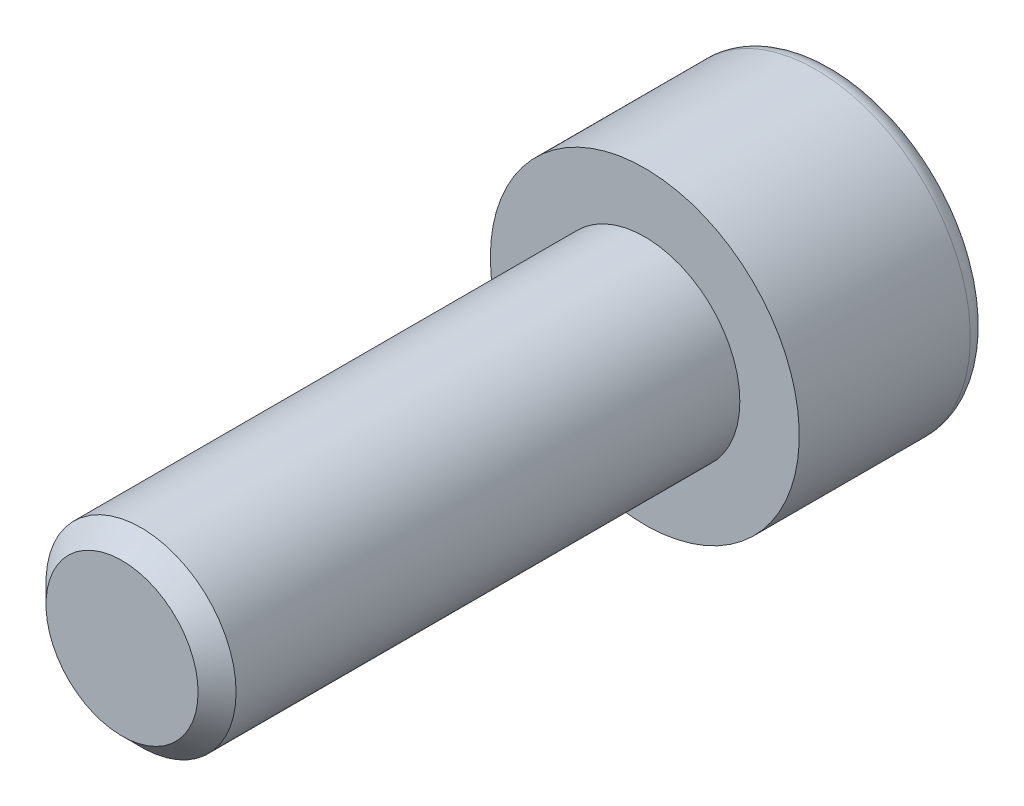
from build123d import *

# Parameters (mm, degrees)
ENLEV_MAT_EXTRU1_DEPTH = 4
ESQUISSE3_W            = 4
ESQUISSE3_H            = 22
CHANFREIN1_SIZE        = 0.8


with BuildPart() as part:
    # Esquisse1 → Base-R_volution (revolve)
    with BuildSketch(Plane(origin=(0, 0, 0), x_dir=(1, 0, 0), z_dir=(0, 1, 0)), mode=Mode.PRIVATE) as base_r_volution_sk:
        with BuildLine():
            Line((0, 0), (6.5, 0))
            Line((6.5, 0), (6.5, 7.2))
            ThreePointArc((6.5, 7.2), (6.265685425, 7.765685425), (5.7, 8))
            Line((5.7, 8), (0, 8))
            Line((0, 8), (0, 0))
        make_face()
    revolve(base_r_volution_sk.sketch.rotate(Axis((0, 0, 0), (0, 0, -1)), 180), axis=Axis((0, 0, 0), (0, 0, -1)))

    # Esquisse2 → enlev-mat-Extru1 (cut)
    with BuildSketch(Plane.XY.offset(-8)):
        Polygon((3, -1.732050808), (3, 1.732050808), (0, 3.464101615), (-3, 1.732050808), (-3, -1.732050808), (0, -3.464101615), align=None)
    extrude(amount=ENLEV_MAT_EXTRU1_DEPTH, mode=Mode.SUBTRACT)

    # Esquisse3 → Boss.-R_vol.1 (revolve)
    with BuildSketch(Plane(origin=(0, 0, 0), x_dir=(1, 0, 0), z_dir=(0, 1, 0))):
        with Locations((2, -11)):
            Rectangle(ESQUISSE3_W, ESQUISSE3_H)
    revolve(axis=Axis((0, 0, 0), (0, 0, 1)))

    # Chanfrein1
    chanfrein1_edges = [part.edges().sort_by_distance(p)[0] for p in [
        (-4, 0, 22),
    ]]
    chamfer(chanfrein1_edges, length=CHANFREIN1_SIZE)


solid = part.part
